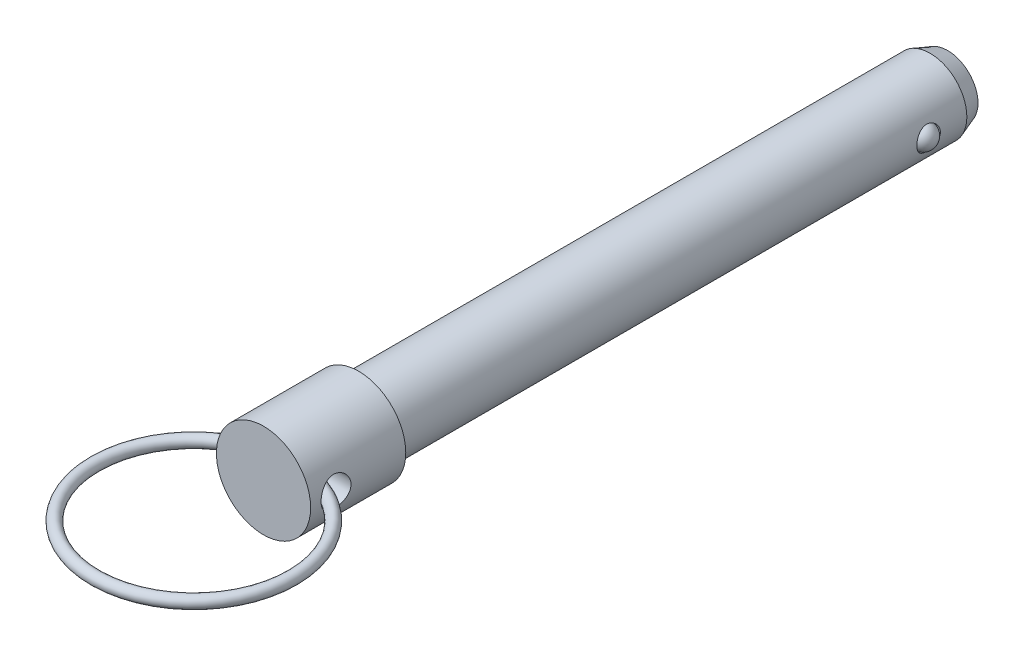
ISO-10303-21;
HEADER;
FILE_DESCRIPTION(('STEP AP214'),'2;1');
FILE_NAME('part.step','',(''),(''),'','','');
FILE_SCHEMA(('AUTOMOTIVE_DESIGN { 1 0 10303 214 1 1 1 1 }'));
ENDSEC;
DATA;
#1=APPLICATION_CONTEXT('core data for automotive mechanical design processes');
#2=APPLICATION_PROTOCOL_DEFINITION('international standard','automotive_design',2000,#1);
#3=PRODUCT_CONTEXT('',#1,'mechanical');
#4=PRODUCT('Part','Part','',(#3));
#5=PRODUCT_RELATED_PRODUCT_CATEGORY('part','',(#4));
#6=PRODUCT_DEFINITION_FORMATION('','',#4);
#7=PRODUCT_DEFINITION_CONTEXT('part definition',#1,'design');
#8=PRODUCT_DEFINITION('design','',#6,#7);
#9=PRODUCT_DEFINITION_SHAPE('','',#8);
#10=(LENGTH_UNIT() NAMED_UNIT(*) SI_UNIT(.MILLI.,.METRE.));
#11=(NAMED_UNIT(*) PLANE_ANGLE_UNIT() SI_UNIT($,.RADIAN.));
#12=(NAMED_UNIT(*) SI_UNIT($,.STERADIAN.) SOLID_ANGLE_UNIT());
#13=UNCERTAINTY_MEASURE_WITH_UNIT(LENGTH_MEASURE(1.E-05),#10,'distance_accuracy_value','');
#14=(GEOMETRIC_REPRESENTATION_CONTEXT(3) GLOBAL_UNCERTAINTY_ASSIGNED_CONTEXT((#13)) GLOBAL_UNIT_ASSIGNED_CONTEXT((#10,
#11,#12)) REPRESENTATION_CONTEXT('',''));
#15=CARTESIAN_POINT('',(0.,0.,0.));
#16=DIRECTION('',(0.,0.,1.));
#17=DIRECTION('',(1.,0.,0.));
#18=AXIS2_PLACEMENT_3D('',#15,#16,#17);
#19=CARTESIAN_POINT('',(7.9375,0.,9.398));
#20=DIRECTION('',(-1.,0.,0.));
#21=DIRECTION('',(0.,0.,-1.));
#22=AXIS2_PLACEMENT_3D('',#19,#20,#21);
#23=CYLINDRICAL_SURFACE('',#22,2.0193);
#24=CARTESIAN_POINT('',(-6.3502,0.292157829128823,11.3960531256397));
#25=CARTESIAN_POINT('',(-6.33446408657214,0.262361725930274,11.4004344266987));
#26=CARTESIAN_POINT('',(-6.32102794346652,0.231225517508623,11.4042829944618));
#27=CARTESIAN_POINT('',(-6.2992523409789,0.167152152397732,11.4106204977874));
#28=CARTESIAN_POINT('',(-6.29090461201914,0.134218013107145,11.413111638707));
#29=CARTESIAN_POINT('',(-6.2797291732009,0.0672091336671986,11.4164621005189));
#30=CARTESIAN_POINT('',(-6.27692077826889,0.0331308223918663,11.4173157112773));
#31=CARTESIAN_POINT('',(-6.27702601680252,-0.0350157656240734,11.4172838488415));
#32=CARTESIAN_POINT('',(-6.27993956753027,-0.0690840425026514,11.4163984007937));
#33=CARTESIAN_POINT('',(-6.29126629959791,-0.135748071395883,11.4130038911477));
#34=CARTESIAN_POINT('',(-6.2996097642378,-0.168356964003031,11.4105154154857));
#35=CARTESIAN_POINT('',(-6.32127848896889,-0.231802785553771,11.404211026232));
#36=CARTESIAN_POINT('',(-6.33461136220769,-0.262636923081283,11.4003930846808));
#37=CARTESIAN_POINT('',(-6.3502,-0.292157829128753,11.3960531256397));
#38=B_SPLINE_CURVE_WITH_KNOTS('',3,(#24,#25,#26,#27,#28,#29,#30,#31,#32,#33,#34,#35,#36,#37),
.UNSPECIFIED.,.F.,.F.,(4,2,2,2,2,2,4),(0.,0.101899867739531,0.203633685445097,0.305721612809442,
0.407808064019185,0.508608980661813,0.609564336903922),.UNSPECIFIED.);
#39=CARTESIAN_POINT('',(-6.3438349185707,0.2797472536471,11.3978284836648));
#40=VERTEX_POINT('',#39);
#41=CARTESIAN_POINT('',(-6.34383491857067,-0.279747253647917,11.3978284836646));
#42=VERTEX_POINT('',#41);
#43=EDGE_CURVE('E40',#40,#42,#38,.T.);
#44=ORIENTED_EDGE('',*,*,#43,.F.);
#45=CARTESIAN_POINT('',(-6.35,0.,11.4173));
#46=CARTESIAN_POINT('',(-6.34999578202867,-0.110312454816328,11.417293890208));
#47=CARTESIAN_POINT('',(-6.34709412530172,-0.220741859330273,11.4082188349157));
#48=CARTESIAN_POINT('',(-6.3357852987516,-0.438477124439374,11.3722159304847));
#49=CARTESIAN_POINT('',(-6.3273687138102,-0.545777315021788,11.3452575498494));
#50=CARTESIAN_POINT('',(-6.30595235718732,-0.753914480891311,11.2744960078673));
#51=CARTESIAN_POINT('',(-6.29296259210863,-0.85476500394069,11.2307296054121));
#52=CARTESIAN_POINT('',(-6.26374009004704,-1.04765917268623,11.1277235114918));
#53=CARTESIAN_POINT('',(-6.24750783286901,-1.13970411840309,11.0684861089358));
#54=CARTESIAN_POINT('',(-6.2129360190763,-1.31536123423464,10.9342184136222));
#55=CARTESIAN_POINT('',(-6.19454917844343,-1.39865352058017,10.8587818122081));
#56=CARTESIAN_POINT('',(-6.15801023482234,-1.55164747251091,10.6951184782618));
#57=CARTESIAN_POINT('',(-6.13985819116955,-1.62134576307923,10.606888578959));
#58=CARTESIAN_POINT('',(-6.1053372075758,-1.74691684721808,10.4173629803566));
#59=CARTESIAN_POINT('',(-6.08902613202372,-1.80238797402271,10.315789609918));
#60=CARTESIAN_POINT('',(-6.06074349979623,-1.89532725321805,10.104153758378));
#61=CARTESIAN_POINT('',(-6.04877073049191,-1.93280043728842,9.99409365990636));
#62=CARTESIAN_POINT('',(-6.03101341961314,-1.9875076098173,9.77220930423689));
#63=CARTESIAN_POINT('',(-6.0250482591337,-2.00533395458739,9.66054596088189));
#64=CARTESIAN_POINT('',(-6.01944581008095,-2.02209234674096,9.43566621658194));
#65=CARTESIAN_POINT('',(-6.01980677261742,-2.02102961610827,9.32245025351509));
#66=CARTESIAN_POINT('',(-6.02665663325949,-2.0005025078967,9.10261826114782));
#67=CARTESIAN_POINT('',(-6.03289303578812,-1.98179631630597,8.99592223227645));
#68=CARTESIAN_POINT('',(-6.05038018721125,-1.92774435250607,8.78726894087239));
#69=CARTESIAN_POINT('',(-6.06163151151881,-1.89239667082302,8.68531222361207));
#70=CARTESIAN_POINT('',(-6.08807105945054,-1.80553890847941,8.48724541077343));
#71=CARTESIAN_POINT('',(-6.1033159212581,-1.75379385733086,8.39124624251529));
#72=CARTESIAN_POINT('',(-6.13599834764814,-1.63577635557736,8.20905256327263));
#73=CARTESIAN_POINT('',(-6.15343637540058,-1.56950083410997,8.12286013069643));
#74=CARTESIAN_POINT('',(-6.18954615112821,-1.42061516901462,7.95845350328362));
#75=CARTESIAN_POINT('',(-6.20823733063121,-1.33738288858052,7.88080597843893));
#76=CARTESIAN_POINT('',(-6.2440320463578,-1.15881168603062,7.74040227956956));
#77=CARTESIAN_POINT('',(-6.26113489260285,-1.06346754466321,7.67765255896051));
#78=CARTESIAN_POINT('',(-6.29201953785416,-0.862230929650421,7.56842117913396));
#79=CARTESIAN_POINT('',(-6.30576997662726,-0.756251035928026,7.5220914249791));
#80=CARTESIAN_POINT('',(-6.32815272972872,-0.537579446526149,7.448167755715));
#81=CARTESIAN_POINT('',(-6.3367955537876,-0.42490206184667,7.4205353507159));
#82=CARTESIAN_POINT('',(-6.34491251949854,-0.259333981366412,7.39474486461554));
#83=CARTESIAN_POINT('',(-6.3468148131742,-0.207677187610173,7.38873516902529));
#84=CARTESIAN_POINT('',(-6.34935954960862,-0.104022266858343,7.38071129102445));
#85=CARTESIAN_POINT('',(-6.35000198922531,-0.0520241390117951,7.37869711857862));
#86=CARTESIAN_POINT('',(-6.34999578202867,0.110312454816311,7.37870610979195));
#87=CARTESIAN_POINT('',(-6.34709412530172,0.220741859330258,7.38778116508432));
#88=CARTESIAN_POINT('',(-6.33578529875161,0.438477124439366,7.4237840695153));
#89=CARTESIAN_POINT('',(-6.32736871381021,0.545777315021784,7.45074245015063));
#90=CARTESIAN_POINT('',(-6.30595235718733,0.753914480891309,7.52150399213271));
#91=CARTESIAN_POINT('',(-6.29296259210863,0.854765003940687,7.56527039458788));
#92=CARTESIAN_POINT('',(-6.26374009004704,1.04765917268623,7.66827648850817));
#93=CARTESIAN_POINT('',(-6.24750783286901,1.13970411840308,7.72751389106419));
#94=CARTESIAN_POINT('',(-6.2129360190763,1.31536123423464,7.86178158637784));
#95=CARTESIAN_POINT('',(-6.19454917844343,1.39865352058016,7.93721818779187));
#96=CARTESIAN_POINT('',(-6.15801023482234,1.55164747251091,8.10088152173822));
#97=CARTESIAN_POINT('',(-6.13985819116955,1.62134576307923,8.18911142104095));
#98=CARTESIAN_POINT('',(-6.1053372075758,1.74691684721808,8.37863701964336));
#99=CARTESIAN_POINT('',(-6.08902613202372,1.80238797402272,8.48021039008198));
#100=CARTESIAN_POINT('',(-6.06074349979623,1.89532725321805,8.69184624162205));
#101=CARTESIAN_POINT('',(-6.04877073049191,1.93280043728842,8.80190634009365));
#102=CARTESIAN_POINT('',(-6.03101341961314,1.9875076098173,9.02379069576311));
#103=CARTESIAN_POINT('',(-6.0250482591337,2.00533395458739,9.13545403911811));
#104=CARTESIAN_POINT('',(-6.01944581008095,2.02209234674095,9.36033378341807));
#105=CARTESIAN_POINT('',(-6.01980677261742,2.02102961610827,9.47354974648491));
#106=CARTESIAN_POINT('',(-6.02665663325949,2.00050250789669,9.69338173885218));
#107=CARTESIAN_POINT('',(-6.03289303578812,1.98179631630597,9.80007776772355));
#108=CARTESIAN_POINT('',(-6.05038018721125,1.92774435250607,10.0087310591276));
#109=CARTESIAN_POINT('',(-6.06163151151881,1.89239667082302,10.1106877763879));
#110=CARTESIAN_POINT('',(-6.08807105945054,1.80553890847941,10.3087545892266));
#111=CARTESIAN_POINT('',(-6.1033159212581,1.75379385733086,10.4047537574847));
#112=CARTESIAN_POINT('',(-6.13599834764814,1.63577635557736,10.5869474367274));
#113=CARTESIAN_POINT('',(-6.15343637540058,1.56950083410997,10.6731398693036));
#114=CARTESIAN_POINT('',(-6.18954615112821,1.42061516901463,10.8375464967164));
#115=CARTESIAN_POINT('',(-6.20823733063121,1.33738288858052,10.9151940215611));
#116=CARTESIAN_POINT('',(-6.2440320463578,1.15881168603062,11.0555977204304));
#117=CARTESIAN_POINT('',(-6.26113489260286,1.06346754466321,11.1183474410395));
#118=CARTESIAN_POINT('',(-6.29201953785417,0.862230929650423,11.227578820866));
#119=CARTESIAN_POINT('',(-6.30576997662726,0.756251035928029,11.2739085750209));
#120=CARTESIAN_POINT('',(-6.32815272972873,0.53757944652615,11.347832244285));
#121=CARTESIAN_POINT('',(-6.33679555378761,0.424902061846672,11.3754646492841));
#122=CARTESIAN_POINT('',(-6.34491251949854,0.25933398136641,11.4012551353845));
#123=CARTESIAN_POINT('',(-6.34681481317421,0.207677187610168,11.4072648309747));
#124=CARTESIAN_POINT('',(-6.34935954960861,0.10402226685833,11.4152887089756));
#125=CARTESIAN_POINT('',(-6.35000198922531,0.0520241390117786,11.4173028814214));
#126=CARTESIAN_POINT('',(-6.35,0.,11.4173));
#127=B_SPLINE_CURVE_WITH_KNOTS('',3,(#45,#46,#47,#48,#49,#50,#51,#52,#53,#54,#55,#56,#57,#58,
#59,#60,#61,#62,#63,#64,#65,#66,#67,#68,#69,#70,#71,#72,#73,#74,#75,#76,#77,#78,#79,#80,#81,#82,
#83,#84,#85,#86,#87,#88,#89,#90,#91,#92,#93,#94,#95,#96,#97,#98,#99,#100,#101,#102,#103,#104,
#105,#106,#107,#108,#109,#110,#111,#112,#113,#114,#115,#116,#117,#118,#119,#120,#121,#122,#123,
#124,#125,#126),.UNSPECIFIED.,.T.,.F.,(4,2,2,2,2,2,2,2,2,2,2,2,2,2,2,2,2,2,2,2,2,2,2,2,2,2,2,2,
2,2,2,2,2,2,2,2,2,2,2,2,4),(0.,0.33073688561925,0.662039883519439,0.992622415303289,
1.32315606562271,1.66322530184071,2.00337886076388,2.35228054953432,2.70108463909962,
3.0390572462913,3.37693642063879,3.70092724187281,4.02495524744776,4.35385413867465,
4.68282260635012,5.02727904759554,5.37188442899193,5.71959937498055,6.06659632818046,
6.22257380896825,6.37855167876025,6.70928856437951,7.04059156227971,7.37117409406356,
7.70170774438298,8.04177698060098,8.38193053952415,8.73083222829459,9.0796363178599,
9.41760892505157,9.75548809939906,10.0794789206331,10.403506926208,10.7324058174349,
11.0613742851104,11.4058307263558,11.7504361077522,12.0981510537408,12.4451480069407,
12.6011254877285,12.7571033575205),.UNSPECIFIED.);
#128=EDGE_CURVE('E66',#42,#40,#127,.T.);
#129=ORIENTED_EDGE('',*,*,#128,.F.);
#130=EDGE_LOOP('',(#44,#129));
#131=FACE_BOUND('',#130,.T.);
#132=CARTESIAN_POINT('',(6.3502,-0.292157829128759,11.3960531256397));
#133=CARTESIAN_POINT('',(6.33446408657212,-0.262361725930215,11.4004344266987));
#134=CARTESIAN_POINT('',(6.32102794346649,-0.231225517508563,11.4042829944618));
#135=CARTESIAN_POINT('',(6.29925234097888,-0.167152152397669,11.4106204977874));
#136=CARTESIAN_POINT('',(6.29090461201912,-0.13421801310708,11.413111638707));
#137=CARTESIAN_POINT('',(6.27972917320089,-0.0672091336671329,11.4164621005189));
#138=CARTESIAN_POINT('',(6.27692077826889,-0.0331308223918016,11.4173157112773));
#139=CARTESIAN_POINT('',(6.27702601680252,0.0350157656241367,11.4172838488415));
#140=CARTESIAN_POINT('',(6.27993956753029,0.0690840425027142,11.4163984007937));
#141=CARTESIAN_POINT('',(6.29126629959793,0.135748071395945,11.4130038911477));
#142=CARTESIAN_POINT('',(6.29960976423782,0.168356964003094,11.4105154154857));
#143=CARTESIAN_POINT('',(6.3212784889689,0.231802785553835,11.4042110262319));
#144=CARTESIAN_POINT('',(6.3346113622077,0.262636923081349,11.4003930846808));
#145=CARTESIAN_POINT('',(6.3502,0.292157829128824,11.3960531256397));
#146=B_SPLINE_CURVE_WITH_KNOTS('',3,(#132,#133,#134,#135,#136,#137,#138,#139,#140,#141,#142,
#143,#144,#145),.UNSPECIFIED.,.F.,.F.,(4,2,2,2,2,2,4),(0.,0.101899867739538,0.203633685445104,
0.305721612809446,0.40780806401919,0.508608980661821,0.609564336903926),.UNSPECIFIED.);
#147=CARTESIAN_POINT('',(6.3438349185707,-0.279747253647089,11.3978284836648));
#148=VERTEX_POINT('',#147);
#149=CARTESIAN_POINT('',(6.34383491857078,0.279747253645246,11.397828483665));
#150=VERTEX_POINT('',#149);
#151=EDGE_CURVE('E33',#148,#150,#146,.T.);
#152=ORIENTED_EDGE('',*,*,#151,.F.);
#153=CARTESIAN_POINT('',(6.35,0.,7.3787));
#154=CARTESIAN_POINT('',(6.34999578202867,-0.110312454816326,7.37870610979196));
#155=CARTESIAN_POINT('',(6.34709412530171,-0.22074185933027,7.38778116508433));
#156=CARTESIAN_POINT('',(6.3357852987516,-0.438477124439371,7.4237840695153));
#157=CARTESIAN_POINT('',(6.32736871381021,-0.545777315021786,7.45074245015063));
#158=CARTESIAN_POINT('',(6.30595235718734,-0.753914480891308,7.52150399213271));
#159=CARTESIAN_POINT('',(6.29296259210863,-0.854765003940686,7.56527039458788));
#160=CARTESIAN_POINT('',(6.26374009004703,-1.04765917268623,7.66827648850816));
#161=CARTESIAN_POINT('',(6.247507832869,-1.13970411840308,7.72751389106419));
#162=CARTESIAN_POINT('',(6.21293601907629,-1.31536123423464,7.86178158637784));
#163=CARTESIAN_POINT('',(6.19454917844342,-1.39865352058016,7.93721818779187));
#164=CARTESIAN_POINT('',(6.15801023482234,-1.55164747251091,8.10088152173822));
#165=CARTESIAN_POINT('',(6.13985819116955,-1.62134576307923,8.18911142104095));
#166=CARTESIAN_POINT('',(6.1053372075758,-1.74691684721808,8.37863701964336));
#167=CARTESIAN_POINT('',(6.08902613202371,-1.80238797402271,8.48021039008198));
#168=CARTESIAN_POINT('',(6.06074349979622,-1.89532725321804,8.69184624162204));
#169=CARTESIAN_POINT('',(6.04877073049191,-1.93280043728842,8.80190634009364));
#170=CARTESIAN_POINT('',(6.03101341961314,-1.9875076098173,9.02379069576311));
#171=CARTESIAN_POINT('',(6.02504825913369,-2.00533395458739,9.13545403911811));
#172=CARTESIAN_POINT('',(6.01944581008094,-2.02209234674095,9.36033378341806));
#173=CARTESIAN_POINT('',(6.01980677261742,-2.02102961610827,9.47354974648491));
#174=CARTESIAN_POINT('',(6.02665663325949,-2.00050250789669,9.69338173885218));
#175=CARTESIAN_POINT('',(6.03289303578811,-1.98179631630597,9.80007776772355));
#176=CARTESIAN_POINT('',(6.05038018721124,-1.92774435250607,10.0087310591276));
#177=CARTESIAN_POINT('',(6.06163151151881,-1.89239667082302,10.1106877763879));
#178=CARTESIAN_POINT('',(6.08807105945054,-1.80553890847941,10.3087545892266));
#179=CARTESIAN_POINT('',(6.1033159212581,-1.75379385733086,10.4047537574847));
#180=CARTESIAN_POINT('',(6.13599834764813,-1.63577635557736,10.5869474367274));
#181=CARTESIAN_POINT('',(6.15343637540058,-1.56950083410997,10.6731398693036));
#182=CARTESIAN_POINT('',(6.18954615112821,-1.42061516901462,10.8375464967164));
#183=CARTESIAN_POINT('',(6.2082373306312,-1.33738288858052,10.9151940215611));
#184=CARTESIAN_POINT('',(6.24403204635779,-1.15881168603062,11.0555977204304));
#185=CARTESIAN_POINT('',(6.26113489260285,-1.06346754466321,11.1183474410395));
#186=CARTESIAN_POINT('',(6.29201953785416,-0.862230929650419,11.227578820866));
#187=CARTESIAN_POINT('',(6.30576997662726,-0.756251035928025,11.2739085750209));
#188=CARTESIAN_POINT('',(6.32815272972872,-0.537579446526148,11.347832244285));
#189=CARTESIAN_POINT('',(6.3367955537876,-0.424902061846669,11.3754646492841));
#190=CARTESIAN_POINT('',(6.34491251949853,-0.25933398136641,11.4012551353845));
#191=CARTESIAN_POINT('',(6.3468148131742,-0.207677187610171,11.4072648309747));
#192=CARTESIAN_POINT('',(6.34935954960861,-0.10402226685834,11.4152887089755));
#193=CARTESIAN_POINT('',(6.35000198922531,-0.0520241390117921,11.4173028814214));
#194=CARTESIAN_POINT('',(6.34999578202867,0.110312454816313,11.417293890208));
#195=CARTESIAN_POINT('',(6.34709412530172,0.220741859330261,11.4082188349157));
#196=CARTESIAN_POINT('',(6.33578529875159,0.438477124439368,11.3722159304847));
#197=CARTESIAN_POINT('',(6.3273687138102,0.545777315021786,11.3452575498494));
#198=CARTESIAN_POINT('',(6.30595235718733,0.753914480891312,11.2744960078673));
#199=CARTESIAN_POINT('',(6.29296259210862,0.854765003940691,11.2307296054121));
#200=CARTESIAN_POINT('',(6.26374009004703,1.04765917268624,11.1277235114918));
#201=CARTESIAN_POINT('',(6.247507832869,1.13970411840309,11.0684861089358));
#202=CARTESIAN_POINT('',(6.21293601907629,1.31536123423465,10.9342184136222));
#203=CARTESIAN_POINT('',(6.19454917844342,1.39865352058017,10.8587818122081));
#204=CARTESIAN_POINT('',(6.15801023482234,1.55164747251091,10.6951184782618));
#205=CARTESIAN_POINT('',(6.13985819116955,1.62134576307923,10.606888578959));
#206=CARTESIAN_POINT('',(6.1053372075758,1.74691684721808,10.4173629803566));
#207=CARTESIAN_POINT('',(6.08902613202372,1.80238797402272,10.315789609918));
#208=CARTESIAN_POINT('',(6.06074349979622,1.89532725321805,10.104153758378));
#209=CARTESIAN_POINT('',(6.0487707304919,1.93280043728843,9.99409365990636));
#210=CARTESIAN_POINT('',(6.03101341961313,1.9875076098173,9.77220930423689));
#211=CARTESIAN_POINT('',(6.02504825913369,2.0053339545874,9.66054596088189));
#212=CARTESIAN_POINT('',(6.01944581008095,2.02209234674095,9.43566621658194));
#213=CARTESIAN_POINT('',(6.01980677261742,2.02102961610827,9.32245025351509));
#214=CARTESIAN_POINT('',(6.02665663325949,2.00050250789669,9.10261826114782));
#215=CARTESIAN_POINT('',(6.03289303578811,1.98179631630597,8.99592223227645));
#216=CARTESIAN_POINT('',(6.05038018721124,1.92774435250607,8.78726894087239));
#217=CARTESIAN_POINT('',(6.06163151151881,1.89239667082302,8.68531222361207));
#218=CARTESIAN_POINT('',(6.08807105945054,1.80553890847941,8.48724541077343));
#219=CARTESIAN_POINT('',(6.1033159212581,1.75379385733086,8.39124624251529));
#220=CARTESIAN_POINT('',(6.13599834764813,1.63577635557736,8.20905256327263));
#221=CARTESIAN_POINT('',(6.15343637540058,1.56950083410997,8.12286013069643));
#222=CARTESIAN_POINT('',(6.18954615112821,1.42061516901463,7.95845350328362));
#223=CARTESIAN_POINT('',(6.2082373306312,1.33738288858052,7.88080597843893));
#224=CARTESIAN_POINT('',(6.24403204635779,1.15881168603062,7.74040227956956));
#225=CARTESIAN_POINT('',(6.26113489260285,1.06346754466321,7.67765255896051));
#226=CARTESIAN_POINT('',(6.29201953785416,0.862230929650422,7.56842117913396));
#227=CARTESIAN_POINT('',(6.30576997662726,0.756251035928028,7.5220914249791));
#228=CARTESIAN_POINT('',(6.32815272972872,0.53757944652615,7.448167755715));
#229=CARTESIAN_POINT('',(6.3367955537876,0.424902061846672,7.4205353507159));
#230=CARTESIAN_POINT('',(6.34491251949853,0.25933398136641,7.39474486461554));
#231=CARTESIAN_POINT('',(6.3468148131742,0.207677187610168,7.38873516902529));
#232=CARTESIAN_POINT('',(6.34935954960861,0.104022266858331,7.38071129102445));
#233=CARTESIAN_POINT('',(6.35000198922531,0.0520241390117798,7.37869711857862));
#234=CARTESIAN_POINT('',(6.35,0.,7.3787));
#235=B_SPLINE_CURVE_WITH_KNOTS('',3,(#153,#154,#155,#156,#157,#158,#159,#160,#161,#162,#163,
#164,#165,#166,#167,#168,#169,#170,#171,#172,#173,#174,#175,#176,#177,#178,#179,#180,#181,#182,
#183,#184,#185,#186,#187,#188,#189,#190,#191,#192,#193,#194,#195,#196,#197,#198,#199,#200,#201,
#202,#203,#204,#205,#206,#207,#208,#209,#210,#211,#212,#213,#214,#215,#216,#217,#218,#219,#220,
#221,#222,#223,#224,#225,#226,#227,#228,#229,#230,#231,#232,#233,#234),.UNSPECIFIED.,.T.,.F.,(4,
2,2,2,2,2,2,2,2,2,2,2,2,2,2,2,2,2,2,2,2,2,2,2,2,2,2,2,2,2,2,2,2,2,2,2,2,2,2,2,4),(0.,
0.330736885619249,0.662039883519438,0.992622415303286,1.32315606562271,1.66322530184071,
2.00337886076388,2.35228054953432,2.70108463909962,3.0390572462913,3.37693642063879,
3.7009272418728,4.02495524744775,4.35385413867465,4.68282260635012,5.02727904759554,
5.37188442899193,5.71959937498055,6.06659632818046,6.22257380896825,6.37855167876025,
6.70928856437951,7.04059156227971,7.37117409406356,7.70170774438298,8.04177698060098,
8.38193053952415,8.73083222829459,9.07963631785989,9.41760892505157,9.75548809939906,
10.0794789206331,10.403506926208,10.7324058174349,11.0613742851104,11.4058307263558,
11.7504361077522,12.0981510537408,12.4451480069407,12.6011254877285,12.7571033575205),.UNSPECIFIED.);
#236=EDGE_CURVE('E62',#150,#148,#235,.T.);
#237=ORIENTED_EDGE('',*,*,#236,.F.);
#238=EDGE_LOOP('',(#152,#237));
#239=FACE_BOUND('',#238,.T.);
#240=ADVANCED_FACE('F14',(#131,#239),#23,.F.);
#241=CARTESIAN_POINT('',(0.,0.,-34.39922));
#242=DIRECTION('',(0.,0.,-1.));
#243=DIRECTION('',(1.,0.,0.));
#244=AXIS2_PLACEMENT_3D('',#241,#242,#243);
#245=CYLINDRICAL_SURFACE('',#244,6.35);
#246=ORIENTED_EDGE('',*,*,#236,.T.);
#247=CARTESIAN_POINT('',(6.34911067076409,-0.106292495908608,9.64531337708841));
#248=CARTESIAN_POINT('',(6.3483941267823,-0.149074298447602,9.65137725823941));
#249=CARTESIAN_POINT('',(6.34724965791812,-0.191344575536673,9.66110939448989));
#250=CARTESIAN_POINT('',(6.34423605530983,-0.273618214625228,9.68758101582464));
#251=CARTESIAN_POINT('',(6.34236646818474,-0.3136201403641,9.704324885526));
#252=CARTESIAN_POINT('',(6.3381174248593,-0.39017545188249,9.74421775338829));
#253=CARTESIAN_POINT('',(6.33573876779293,-0.42673411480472,9.76735672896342));
#254=CARTESIAN_POINT('',(6.33072830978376,-0.495552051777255,9.8192835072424));
#255=CARTESIAN_POINT('',(6.32809652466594,-0.527811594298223,9.84807095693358));
#256=CARTESIAN_POINT('',(6.32277775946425,-0.588154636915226,9.91124388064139));
#257=CARTESIAN_POINT('',(6.32009122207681,-0.616100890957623,9.94576018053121));
#258=CARTESIAN_POINT('',(6.31500218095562,-0.666246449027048,10.0187508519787));
#259=CARTESIAN_POINT('',(6.31259974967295,-0.688444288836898,10.0572262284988));
#260=CARTESIAN_POINT('',(6.30814194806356,-0.72820004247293,10.1398945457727));
#261=CARTESIAN_POINT('',(6.30612298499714,-0.745320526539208,10.1842993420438));
#262=CARTESIAN_POINT('',(6.30283333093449,-0.772645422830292,10.2752074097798));
#263=CARTESIAN_POINT('',(6.30156294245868,-0.782847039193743,10.3217115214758));
#264=CARTESIAN_POINT('',(6.2997729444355,-0.797132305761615,10.4203656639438));
#265=CARTESIAN_POINT('',(6.29934001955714,-0.800511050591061,10.4726191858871));
#266=CARTESIAN_POINT('',(6.29948539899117,-0.799363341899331,10.5770343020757));
#267=CARTESIAN_POINT('',(6.30006412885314,-0.79483356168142,10.6291958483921));
#268=CARTESIAN_POINT('',(6.30224519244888,-0.777362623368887,10.7373900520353));
#269=CARTESIAN_POINT('',(6.30394321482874,-0.763632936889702,10.7932945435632));
#270=CARTESIAN_POINT('',(6.3082304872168,-0.727364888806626,10.9021925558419));
#271=CARTESIAN_POINT('',(6.31082057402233,-0.704818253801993,10.9551832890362));
#272=CARTESIAN_POINT('',(6.31668084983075,-0.65024958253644,11.058462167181));
#273=CARTESIAN_POINT('',(6.31997188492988,-0.617920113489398,11.108588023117));
#274=CARTESIAN_POINT('',(6.32672369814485,-0.544444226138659,11.2018715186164));
#275=CARTESIAN_POINT('',(6.33018413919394,-0.503314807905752,11.2450423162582));
#276=CARTESIAN_POINT('',(6.33576833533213,-0.426106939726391,11.3105875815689));
#277=CARTESIAN_POINT('',(6.3379874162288,-0.392058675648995,11.3353540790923));
#278=CARTESIAN_POINT('',(6.34201635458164,-0.320334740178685,11.378985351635));
#279=CARTESIAN_POINT('',(6.34382654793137,-0.282662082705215,11.3978549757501));
#280=CARTESIAN_POINT('',(6.34683709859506,-0.204222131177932,11.4286907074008));
#281=CARTESIAN_POINT('',(6.34803303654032,-0.163434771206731,11.4406068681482));
#282=CARTESIAN_POINT('',(6.34962760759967,-0.080315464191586,11.456409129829));
#283=CARTESIAN_POINT('',(6.35002678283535,-0.0379845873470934,11.4603006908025));
#284=CARTESIAN_POINT('',(6.34997361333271,0.0416311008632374,11.4597766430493));
#285=CARTESIAN_POINT('',(6.34961570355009,0.0789250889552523,11.4562823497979));
#286=CARTESIAN_POINT('',(6.34827799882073,0.152365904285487,11.4430416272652));
#287=CARTESIAN_POINT('',(6.34729819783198,0.188512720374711,11.4332951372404));
#288=CARTESIAN_POINT('',(6.34483463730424,0.258437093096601,11.4082426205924));
#289=CARTESIAN_POINT('',(6.34335520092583,0.292232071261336,11.392984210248));
#290=CARTESIAN_POINT('',(6.3400309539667,0.35716430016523,11.3576448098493));
#291=CARTESIAN_POINT('',(6.33818602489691,0.388300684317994,11.3375622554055));
#292=CARTESIAN_POINT('',(6.33403341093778,0.451264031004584,11.2905464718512));
#293=CARTESIAN_POINT('',(6.33169671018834,0.482680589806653,11.2630681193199));
#294=CARTESIAN_POINT('',(6.32695276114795,0.541327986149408,11.2039742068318));
#295=CARTESIAN_POINT('',(6.32454547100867,0.568556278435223,11.1723561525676));
#296=CARTESIAN_POINT('',(6.31940966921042,0.623257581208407,11.0997303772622));
#297=CARTESIAN_POINT('',(6.31670324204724,0.649859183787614,11.0580641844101));
#298=CARTESIAN_POINT('',(6.31169900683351,0.696787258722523,10.9713122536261));
#299=CARTESIAN_POINT('',(6.30940147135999,0.717109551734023,10.9262242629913));
#300=CARTESIAN_POINT('',(6.30511939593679,0.753900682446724,10.8265682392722));
#301=CARTESIAN_POINT('',(6.30323580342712,0.769311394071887,10.7716021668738));
#302=CARTESIAN_POINT('',(6.30052520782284,0.791204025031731,10.6598731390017));
#303=CARTESIAN_POINT('',(6.2996986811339,0.79768191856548,10.6031093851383));
#304=CARTESIAN_POINT('',(6.29923241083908,0.80136018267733,10.4867557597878));
#305=CARTESIAN_POINT('',(6.2996462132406,0.798141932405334,10.4271509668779));
#306=CARTESIAN_POINT('',(6.30178827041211,0.781050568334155,10.3094933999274));
#307=CARTESIAN_POINT('',(6.30351599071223,0.767181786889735,10.2514400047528));
#308=CARTESIAN_POINT('',(6.30793273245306,0.729936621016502,10.1430301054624));
#309=CARTESIAN_POINT('',(6.31054579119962,0.707295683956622,10.0924193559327));
#310=CARTESIAN_POINT('',(6.316412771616,0.652821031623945,9.9964473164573));
#311=CARTESIAN_POINT('',(6.31966615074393,0.620995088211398,9.95108163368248));
#312=CARTESIAN_POINT('',(6.3259599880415,0.552954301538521,9.87232840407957));
#313=CARTESIAN_POINT('',(6.32898344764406,0.517631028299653,9.83816824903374));
#314=CARTESIAN_POINT('',(6.33476504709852,0.441261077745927,9.77694761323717));
#315=CARTESIAN_POINT('',(6.33752330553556,0.400216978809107,9.74988394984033));
#316=CARTESIAN_POINT('',(6.34218417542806,0.317440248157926,9.70596453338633));
#317=CARTESIAN_POINT('',(6.34413984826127,0.276067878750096,9.68843287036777));
#318=CARTESIAN_POINT('',(6.34727291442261,0.19088190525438,9.66089843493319));
#319=CARTESIAN_POINT('',(6.34845102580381,0.147070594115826,9.65088871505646));
#320=CARTESIAN_POINT('',(6.34972965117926,0.0681015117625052,9.64007587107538));
#321=CARTESIAN_POINT('',(6.35000959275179,0.0331486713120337,9.63773711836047));
#322=CARTESIAN_POINT('',(6.34998989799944,-0.0367451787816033,9.63790342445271));
#323=CARTESIAN_POINT('',(6.34969028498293,-0.0716861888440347,9.64040828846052));
#324=CARTESIAN_POINT('',(6.34911067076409,-0.106292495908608,9.64531337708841));
#325=B_SPLINE_CURVE_WITH_KNOTS('',3,(#247,#248,#249,#250,#251,#252,#253,#254,#255,#256,#257,
#258,#259,#260,#261,#262,#263,#264,#265,#266,#267,#268,#269,#270,#271,#272,#273,#274,#275,#276,
#277,#278,#279,#280,#281,#282,#283,#284,#285,#286,#287,#288,#289,#290,#291,#292,#293,#294,#295,
#296,#297,#298,#299,#300,#301,#302,#303,#304,#305,#306,#307,#308,#309,#310,#311,#312,#313,#314,
#315,#316,#317,#318,#319,#320,#321,#322,#323,#324),.UNSPECIFIED.,.T.,.F.,(4,2,2,2,2,2,2,2,2,2,2,
2,2,2,2,2,2,2,2,2,2,2,2,2,2,2,2,2,2,2,2,2,2,2,2,2,2,2,4),(0.,0.129515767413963,
0.259112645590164,0.388507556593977,0.517894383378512,0.650795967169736,0.783731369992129,
0.926038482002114,1.06840306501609,1.22484845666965,1.38135967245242,1.55336962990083,
1.72554138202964,1.90381365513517,2.08174459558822,2.20773649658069,2.33362451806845,
2.4604060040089,2.58710119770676,2.69892768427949,2.81075525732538,2.92163901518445,
3.0325587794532,3.15750232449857,3.28252150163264,3.4304749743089,3.57852670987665,
3.74912471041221,3.91979957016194,4.09794717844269,4.27602235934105,4.44160182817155,
4.60704160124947,4.7539407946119,4.90077399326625,5.03502725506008,5.1691563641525,
5.27392620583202,5.37869183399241),.UNSPECIFIED.);
#326=EDGE_CURVE('E27',#148,#150,#325,.T.);
#327=ORIENTED_EDGE('',*,*,#326,.T.);
#328=EDGE_LOOP('',(#246,#327));
#329=FACE_BOUND('',#328,.T.);
#330=CARTESIAN_POINT('',(0.,0.,12.8270000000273));
#331=DIRECTION('',(0.,0.,-1.));
#332=DIRECTION('',(1.,0.,0.));
#333=AXIS2_PLACEMENT_3D('',#330,#331,#332);
#334=CIRCLE('',#333,6.34999999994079);
#335=CARTESIAN_POINT('',(6.34999999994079,0.,12.8270000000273));
#336=VERTEX_POINT('',#335);
#337=EDGE_CURVE('E70',#336,#336,#334,.T.);
#338=ORIENTED_EDGE('',*,*,#337,.T.);
#339=EDGE_LOOP('',(#338));
#340=FACE_BOUND('',#339,.T.);
#341=CARTESIAN_POINT('',(0.,0.,1.16018306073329E-11));
#342=DIRECTION('',(0.,0.,-1.));
#343=DIRECTION('',(1.,0.,0.));
#344=AXIS2_PLACEMENT_3D('',#341,#342,#343);
#345=CIRCLE('',#344,6.34999999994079);
#346=CARTESIAN_POINT('',(6.34999999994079,0.,1.16015507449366E-11));
#347=VERTEX_POINT('',#346);
#348=EDGE_CURVE('E60',#347,#347,#345,.T.);
#349=ORIENTED_EDGE('',*,*,#348,.F.);
#350=EDGE_LOOP('',(#349));
#351=FACE_BOUND('',#350,.T.);
#352=ORIENTED_EDGE('',*,*,#128,.T.);
#353=CARTESIAN_POINT('',(-6.3491106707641,-0.106292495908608,9.64531337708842));
#354=CARTESIAN_POINT('',(-6.34981427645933,-0.0642492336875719,9.63935614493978));
#355=CARTESIAN_POINT('',(-6.35010491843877,-0.0216882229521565,9.63693832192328));
#356=CARTESIAN_POINT('',(-6.34982708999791,0.0632451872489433,9.63926820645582));
#357=CARTESIAN_POINT('',(-6.34925830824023,0.105617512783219,9.64401851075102));
#358=CARTESIAN_POINT('',(-6.3473255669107,0.188929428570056,9.66052387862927));
#359=CARTESIAN_POINT('',(-6.34596206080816,0.229869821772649,9.67227494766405));
#360=CARTESIAN_POINT('',(-6.34259173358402,0.309205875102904,9.7023861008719));
#361=CARTESIAN_POINT('',(-6.34058494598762,0.347601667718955,9.72074584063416));
#362=CARTESIAN_POINT('',(-6.33612262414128,0.421219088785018,9.76368889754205));
#363=CARTESIAN_POINT('',(-6.33366281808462,0.456405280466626,9.78833239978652));
#364=CARTESIAN_POINT('',(-6.3285674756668,0.522330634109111,9.84295801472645));
#365=CARTESIAN_POINT('',(-6.32593191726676,0.553069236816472,9.87294079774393));
#366=CARTESIAN_POINT('',(-6.32063739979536,0.610668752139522,9.93869049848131));
#367=CARTESIAN_POINT('',(-6.31798210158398,0.637312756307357,9.97464737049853));
#368=CARTESIAN_POINT('',(-6.31302530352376,0.684675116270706,10.050284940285));
#369=CARTESIAN_POINT('',(-6.31072390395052,0.705391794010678,10.0899666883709));
#370=CARTESIAN_POINT('',(-6.3065253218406,0.742027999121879,10.1750481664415));
#371=CARTESIAN_POINT('',(-6.30467116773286,0.757473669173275,10.2206536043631));
#372=CARTESIAN_POINT('',(-6.30176158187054,0.781309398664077,10.3136897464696));
#373=CARTESIAN_POINT('',(-6.30070647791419,0.789696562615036,10.3611211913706));
#374=CARTESIAN_POINT('',(-6.29939708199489,0.800080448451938,10.4615517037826));
#375=CARTESIAN_POINT('',(-6.29923479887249,0.801343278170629,10.5146278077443));
#376=CARTESIAN_POINT('',(-6.29993274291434,0.795834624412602,10.6203535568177));
#377=CARTESIAN_POINT('',(-6.30079341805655,0.789059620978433,10.6730030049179));
#378=CARTESIAN_POINT('',(-6.30354435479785,0.76679085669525,10.7816321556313));
#379=CARTESIAN_POINT('',(-6.3055245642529,0.75053077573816,10.8374538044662));
#380=CARTESIAN_POINT('',(-6.3103170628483,0.709106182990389,10.9457204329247));
#381=CARTESIAN_POINT('',(-6.31313013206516,0.683933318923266,10.9981621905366));
#382=CARTESIAN_POINT('',(-6.31930287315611,0.624362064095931,11.0989766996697));
#383=CARTESIAN_POINT('',(-6.32267249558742,0.589786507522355,11.1472450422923));
#384=CARTESIAN_POINT('',(-6.32944316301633,0.512016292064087,11.2362287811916));
#385=CARTESIAN_POINT('',(-6.33284412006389,0.468841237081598,11.2769609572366));
#386=CARTESIAN_POINT('',(-6.3381447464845,0.389210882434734,11.3371705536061));
#387=CARTESIAN_POINT('',(-6.34018413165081,0.354783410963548,11.3593300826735));
#388=CARTESIAN_POINT('',(-6.34380499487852,0.282727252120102,11.3976985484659));
#389=CARTESIAN_POINT('',(-6.34538687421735,0.24510140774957,11.4139127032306));
#390=CARTESIAN_POINT('',(-6.34791613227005,0.16728046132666,11.4394899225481));
#391=CARTESIAN_POINT('',(-6.34885950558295,0.127070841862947,11.4488097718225));
#392=CARTESIAN_POINT('',(-6.34996657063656,0.0456031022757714,11.459723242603));
#393=CARTESIAN_POINT('',(-6.35013061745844,0.00434546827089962,11.4613203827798));
#394=CARTESIAN_POINT('',(-6.34968170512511,-0.0735082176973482,11.4569121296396));
#395=CARTESIAN_POINT('',(-6.34914631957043,-0.110150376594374,11.4516658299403));
#396=CARTESIAN_POINT('',(-6.34749195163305,-0.182042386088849,11.4351966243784));
#397=CARTESIAN_POINT('',(-6.3463729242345,-0.217292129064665,11.4239732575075));
#398=CARTESIAN_POINT('',(-6.34364878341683,-0.286046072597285,11.3959879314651));
#399=CARTESIAN_POINT('',(-6.34203717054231,-0.31951944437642,11.379151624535));
#400=CARTESIAN_POINT('',(-6.33848327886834,-0.383617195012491,11.3407750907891));
#401=CARTESIAN_POINT('',(-6.336540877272,-0.414240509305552,11.3192331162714));
#402=CARTESIAN_POINT('',(-6.33219640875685,-0.476327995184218,11.2689534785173));
#403=CARTESIAN_POINT('',(-6.32976799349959,-0.507315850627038,11.2396315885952));
#404=CARTESIAN_POINT('',(-6.32489282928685,-0.564859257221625,11.1769313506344));
#405=CARTESIAN_POINT('',(-6.32244606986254,-0.591412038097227,11.1435504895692));
#406=CARTESIAN_POINT('',(-6.31728331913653,-0.644412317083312,11.0671373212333));
#407=CARTESIAN_POINT('',(-6.31460099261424,-0.669935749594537,11.0234608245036));
#408=CARTESIAN_POINT('',(-6.3097291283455,-0.714365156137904,10.9328329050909));
#409=CARTESIAN_POINT('',(-6.30753991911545,-0.733266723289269,10.8858793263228));
#410=CARTESIAN_POINT('',(-6.30360262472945,-0.766429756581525,10.7829444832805));
#411=CARTESIAN_POINT('',(-6.30196031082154,-0.779660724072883,10.7266239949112));
#412=CARTESIAN_POINT('',(-6.29981098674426,-0.796841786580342,10.6125408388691));
#413=CARTESIAN_POINT('',(-6.29930438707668,-0.800788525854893,10.5547776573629));
#414=CARTESIAN_POINT('',(-6.29954116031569,-0.798927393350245,10.4378617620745));
#415=CARTESIAN_POINT('',(-6.30031766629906,-0.792860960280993,10.3787123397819));
#416=CARTESIAN_POINT('',(-6.3031448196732,-0.770063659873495,10.2625195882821));
#417=CARTESIAN_POINT('',(-6.30519479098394,-0.753338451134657,10.2054751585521));
#418=CARTESIAN_POINT('',(-6.31011127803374,-0.710921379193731,10.100203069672));
#419=CARTESIAN_POINT('',(-6.31289804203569,-0.686067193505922,10.0516355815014));
#420=CARTESIAN_POINT('',(-6.31897863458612,-0.627588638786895,9.96012359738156));
#421=CARTESIAN_POINT('',(-6.32227210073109,-0.593970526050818,9.91717512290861));
#422=CARTESIAN_POINT('',(-6.32851172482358,-0.523028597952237,9.84320836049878));
#423=CARTESIAN_POINT('',(-6.33145578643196,-0.486532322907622,9.81139456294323));
#424=CARTESIAN_POINT('',(-6.33697928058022,-0.408315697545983,9.75500457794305));
#425=CARTESIAN_POINT('',(-6.33955910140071,-0.36660100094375,9.73042065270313));
#426=CARTESIAN_POINT('',(-6.34352567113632,-0.288721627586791,9.69390061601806));
#427=CARTESIAN_POINT('',(-6.34504971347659,-0.253297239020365,9.68038073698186));
#428=CARTESIAN_POINT('',(-6.34752864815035,-0.18081626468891,9.65874203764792));
#429=CARTESIAN_POINT('',(-6.34848364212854,-0.143759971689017,9.65062225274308));
#430=CARTESIAN_POINT('',(-6.3491106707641,-0.106292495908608,9.64531337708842));
#431=B_SPLINE_CURVE_WITH_KNOTS('',3,(#353,#354,#355,#356,#357,#358,#359,#360,#361,#362,#363,
#364,#365,#366,#367,#368,#369,#370,#371,#372,#373,#374,#375,#376,#377,#378,#379,#380,#381,#382,
#383,#384,#385,#386,#387,#388,#389,#390,#391,#392,#393,#394,#395,#396,#397,#398,#399,#400,#401,
#402,#403,#404,#405,#406,#407,#408,#409,#410,#411,#412,#413,#414,#415,#416,#417,#418,#419,#420,
#421,#422,#423,#424,#425,#426,#427,#428,#429,#430),.UNSPECIFIED.,.T.,.F.,(4,2,2,2,2,2,2,2,2,2,2,
2,2,2,2,2,2,2,2,2,2,2,2,2,2,2,2,2,2,2,2,2,2,2,2,2,2,2,4),(0.,0.127270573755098,
0.254587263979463,0.381831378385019,0.50906886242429,0.637574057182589,0.766095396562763,
0.900011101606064,1.03396468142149,1.17792305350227,1.32194045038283,1.48055524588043,
1.63923952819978,1.81298136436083,1.98688644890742,2.16432734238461,2.34136826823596,
2.46386496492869,2.58625389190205,2.70940363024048,2.83249725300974,2.94303106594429,
3.05357340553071,3.16564234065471,3.27775296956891,3.40546920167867,3.53326491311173,
3.6846489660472,3.83613357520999,4.00898453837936,4.18189796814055,4.35934661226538,
4.53670112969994,4.69966495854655,4.86251276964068,5.00725534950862,5.15184244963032,
5.26528177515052,5.3787008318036),.UNSPECIFIED.);
#432=EDGE_CURVE('E9',#40,#42,#431,.T.);
#433=ORIENTED_EDGE('',*,*,#432,.T.);
#434=EDGE_LOOP('',(#352,#433));
#435=FACE_BOUND('',#434,.T.);
#436=ADVANCED_FACE('F64',(#329,#340,#351,#435),#245,.T.);
#437=CARTESIAN_POINT('',(0.,0.,0.));
#438=DIRECTION('',(0.,0.,-1.));
#439=DIRECTION('',(-1.,0.,0.));
#440=AXIS2_PLACEMENT_3D('',#437,#438,#439);
#441=PLANE('',#440);
#442=ORIENTED_EDGE('',*,*,#348,.T.);
#443=EDGE_LOOP('',(#442));
#444=FACE_BOUND('',#443,.T.);
#445=CARTESIAN_POINT('',(0.,0.,-1.11299858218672E-11));
#446=DIRECTION('',(0.,0.,-1.));
#447=DIRECTION('',(-1.,0.,0.));
#448=AXIS2_PLACEMENT_3D('',#445,#446,#447);
#449=CIRCLE('',#448,4.95554);
#450=CARTESIAN_POINT('',(-4.95554,0.,-1.11305926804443E-11));
#451=VERTEX_POINT('',#450);
#452=EDGE_CURVE('E67',#451,#451,#449,.T.);
#453=ORIENTED_EDGE('',*,*,#452,.F.);
#454=EDGE_LOOP('',(#453));
#455=FACE_BOUND('',#454,.T.);
#456=ADVANCED_FACE('F16',(#444,#455),#441,.T.);
#457=CARTESIAN_POINT('',(0.,-6.096,12.827));
#458=DIRECTION('',(0.,0.,1.));
#459=DIRECTION('',(-1.,0.,0.));
#460=AXIS2_PLACEMENT_3D('',#457,#458,#459);
#461=PLANE('',#460);
#462=ORIENTED_EDGE('',*,*,#337,.F.);
#463=EDGE_LOOP('',(#462));
#464=FACE_BOUND('',#463,.T.);
#465=ADVANCED_FACE('F183',(#464),#461,.T.);
#466=CARTESIAN_POINT('',(0.,7.24262754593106E-11,499940.60078));
#467=DIRECTION('',(0.,0.,-1.));
#468=DIRECTION('',(-1.,0.,0.));
#469=AXIS2_PLACEMENT_3D('',#466,#467,#468);
#470=CYLINDRICAL_SURFACE('',#469,4.95554);
#471=ORIENTED_EDGE('',*,*,#452,.T.);
#472=EDGE_LOOP('',(#471));
#473=FACE_BOUND('',#472,.T.);
#474=CARTESIAN_POINT('',(4.95554,0.,-70.29332));
#475=CARTESIAN_POINT('',(4.95553666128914,0.0866897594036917,-70.2933248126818));
#476=CARTESIAN_POINT('',(4.95324045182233,0.173471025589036,-70.3004537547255));
#477=CARTESIAN_POINT('',(4.9442912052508,0.344577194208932,-70.3287349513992));
#478=CARTESIAN_POINT('',(4.9376307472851,0.428897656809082,-70.3499110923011));
#479=CARTESIAN_POINT('',(4.92068254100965,0.592457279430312,-70.4054922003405));
#480=CARTESIAN_POINT('',(4.9104027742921,0.671707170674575,-70.4398680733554));
#481=CARTESIAN_POINT('',(4.88727518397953,0.823288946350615,-70.5207700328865));
#482=CARTESIAN_POINT('',(4.87442773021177,0.895621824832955,-70.5672943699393));
#483=CARTESIAN_POINT('',(4.84705629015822,1.03369400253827,-70.6727644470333));
#484=CARTESIAN_POINT('',(4.83249427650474,1.09917878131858,-70.7320335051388));
#485=CARTESIAN_POINT('',(4.80355063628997,1.21947281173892,-70.860625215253));
#486=CARTESIAN_POINT('',(4.78916905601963,1.27427937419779,-70.9299503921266));
#487=CARTESIAN_POINT('',(4.76180578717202,1.37305673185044,-71.0789084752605));
#488=CARTESIAN_POINT('',(4.74887057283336,1.41670648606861,-71.1587636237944));
#489=CARTESIAN_POINT('',(4.72643603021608,1.48985016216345,-71.3251622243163));
#490=CARTESIAN_POINT('',(4.71693572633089,1.51934810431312,-71.4117037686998));
#491=CARTESIAN_POINT('',(4.70284355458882,1.56241523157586,-71.5861508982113));
#492=CARTESIAN_POINT('',(4.69810668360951,1.57645629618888,-71.6739279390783));
#493=CARTESIAN_POINT('',(4.69364777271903,1.58968567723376,-71.8507099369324));
#494=CARTESIAN_POINT('',(4.69392432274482,1.58887816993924,-71.9397145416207));
#495=CARTESIAN_POINT('',(4.6993333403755,1.5728014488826,-72.1124771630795));
#496=CARTESIAN_POINT('',(4.70426240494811,1.55813797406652,-72.1962990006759));
#497=CARTESIAN_POINT('',(4.71808978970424,1.51574977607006,-72.3602240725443));
#498=CARTESIAN_POINT('',(4.72698857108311,1.48802353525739,-72.4403268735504));
#499=CARTESIAN_POINT('',(4.74790477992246,1.41987997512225,-72.5959596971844));
#500=CARTESIAN_POINT('',(4.75996755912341,1.37927613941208,-72.6714016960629));
#501=CARTESIAN_POINT('',(4.78583160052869,1.286661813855,-72.8145932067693));
#502=CARTESIAN_POINT('',(4.79963323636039,1.234648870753,-72.8823410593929));
#503=CARTESIAN_POINT('',(4.82822844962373,1.11775274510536,-73.0116328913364));
#504=CARTESIAN_POINT('',(4.84303789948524,1.05237301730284,-73.0727252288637));
#505=CARTESIAN_POINT('',(4.87140539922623,0.912085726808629,-73.1832136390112));
#506=CARTESIAN_POINT('',(4.88496290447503,0.837174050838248,-73.2326046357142));
#507=CARTESIAN_POINT('',(4.90945634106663,0.679024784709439,-73.3186171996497));
#508=CARTESIAN_POINT('',(4.92036685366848,0.595716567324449,-73.3551163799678));
#509=CARTESIAN_POINT('',(4.93813643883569,0.42380281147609,-73.4133833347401));
#510=CARTESIAN_POINT('',(4.94500382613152,0.335208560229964,-73.435181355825));
#511=CARTESIAN_POINT('',(4.95147275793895,0.204839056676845,-73.4555865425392));
#512=CARTESIAN_POINT('',(4.95299354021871,0.164038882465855,-73.4603558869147));
#513=CARTESIAN_POINT('',(4.95502795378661,0.0821659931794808,-73.4667237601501));
#514=CARTESIAN_POINT('',(4.95554158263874,0.0410932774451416,-73.4683222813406));
#515=CARTESIAN_POINT('',(4.95553666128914,-0.0866897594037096,-73.4683151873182));
#516=CARTESIAN_POINT('',(4.95324045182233,-0.173471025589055,-73.4611862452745));
#517=CARTESIAN_POINT('',(4.9442912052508,-0.344577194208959,-73.4329050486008));
#518=CARTESIAN_POINT('',(4.9376307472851,-0.428897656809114,-73.4117289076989));
#519=CARTESIAN_POINT('',(4.92068254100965,-0.592457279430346,-73.3561477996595));
#520=CARTESIAN_POINT('',(4.9104027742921,-0.671707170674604,-73.3217719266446));
#521=CARTESIAN_POINT('',(4.88727518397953,-0.823288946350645,-73.2408699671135));
#522=CARTESIAN_POINT('',(4.87442773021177,-0.895621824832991,-73.1943456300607));
#523=CARTESIAN_POINT('',(4.84705629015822,-1.03369400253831,-73.0888755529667));
#524=CARTESIAN_POINT('',(4.83249427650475,-1.09917878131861,-73.0296064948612));
#525=CARTESIAN_POINT('',(4.80355063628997,-1.21947281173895,-72.901014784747));
#526=CARTESIAN_POINT('',(4.78916905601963,-1.27427937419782,-72.8316896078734));
#527=CARTESIAN_POINT('',(4.76180578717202,-1.37305673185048,-72.6827315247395));
#528=CARTESIAN_POINT('',(4.74887057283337,-1.41670648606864,-72.6028763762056));
#529=CARTESIAN_POINT('',(4.72643603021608,-1.48985016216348,-72.4364777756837));
#530=CARTESIAN_POINT('',(4.71693572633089,-1.51934810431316,-72.3499362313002));
#531=CARTESIAN_POINT('',(4.70284355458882,-1.5624152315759,-72.1754891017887));
#532=CARTESIAN_POINT('',(4.69810668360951,-1.57645629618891,-72.0877120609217));
#533=CARTESIAN_POINT('',(4.69364777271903,-1.58968567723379,-71.9109300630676));
#534=CARTESIAN_POINT('',(4.69392432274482,-1.58887816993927,-71.8219254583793));
#535=CARTESIAN_POINT('',(4.6993333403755,-1.57280144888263,-71.6491628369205));
#536=CARTESIAN_POINT('',(4.70426240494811,-1.55813797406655,-71.5653409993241));
#537=CARTESIAN_POINT('',(4.71808978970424,-1.51574977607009,-71.4014159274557));
#538=CARTESIAN_POINT('',(4.72698857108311,-1.48802353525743,-71.3213131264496));
#539=CARTESIAN_POINT('',(4.74790477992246,-1.41987997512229,-71.1656803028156));
#540=CARTESIAN_POINT('',(4.7599675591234,-1.37927613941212,-71.0902383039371));
#541=CARTESIAN_POINT('',(4.78583160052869,-1.28666181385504,-70.9470467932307));
#542=CARTESIAN_POINT('',(4.79963323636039,-1.23464887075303,-70.8792989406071));
#543=CARTESIAN_POINT('',(4.82822844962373,-1.11775274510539,-70.7500071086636));
#544=CARTESIAN_POINT('',(4.84303789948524,-1.05237301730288,-70.6889147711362));
#545=CARTESIAN_POINT('',(4.87140539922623,-0.912085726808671,-70.5784263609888));
#546=CARTESIAN_POINT('',(4.88496290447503,-0.837174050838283,-70.5290353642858));
#547=CARTESIAN_POINT('',(4.90945634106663,-0.679024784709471,-70.4430228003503));
#548=CARTESIAN_POINT('',(4.92036685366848,-0.595716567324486,-70.4065236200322));
#549=CARTESIAN_POINT('',(4.93813643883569,-0.423802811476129,-70.3482566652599));
#550=CARTESIAN_POINT('',(4.94500382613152,-0.335208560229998,-70.326458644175));
#551=CARTESIAN_POINT('',(4.95147275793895,-0.204839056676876,-70.3060534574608));
#552=CARTESIAN_POINT('',(4.95299354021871,-0.164038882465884,-70.3012841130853));
#553=CARTESIAN_POINT('',(4.95502795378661,-0.0821659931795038,-70.2949162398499));
#554=CARTESIAN_POINT('',(4.95554158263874,-0.0410932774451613,-70.2933177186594));
#555=CARTESIAN_POINT('',(4.95554,0.,-70.29332));
#556=B_SPLINE_CURVE_WITH_KNOTS('',3,(#474,#475,#476,#477,#478,#479,#480,#481,#482,#483,#484,
#485,#486,#487,#488,#489,#490,#491,#492,#493,#494,#495,#496,#497,#498,#499,#500,#501,#502,#503,
#504,#505,#506,#507,#508,#509,#510,#511,#512,#513,#514,#515,#516,#517,#518,#519,#520,#521,#522,
#523,#524,#525,#526,#527,#528,#529,#530,#531,#532,#533,#534,#535,#536,#537,#538,#539,#540,#541,
#542,#543,#544,#545,#546,#547,#548,#549,#550,#551,#552,#553,#554,#555),.UNSPECIFIED.,.T.,.F.,(4,
2,2,2,2,2,2,2,2,2,2,2,2,2,2,2,2,2,2,2,2,2,2,2,2,2,2,2,2,2,2,2,2,2,2,2,2,2,2,2,4),(0.,
0.259910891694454,0.520264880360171,0.780048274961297,1.03979427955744,1.30713240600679,
1.57453777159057,1.84893984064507,2.12326391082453,2.38895860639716,2.65457857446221,
2.90909875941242,3.16364852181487,3.42206782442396,3.6805427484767,3.95137896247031,
4.22233244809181,4.49579311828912,4.76868943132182,4.89189388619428,5.01509863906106,
5.27500953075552,5.53536351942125,5.79514691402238,6.05489291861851,6.32223104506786,
6.58963641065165,6.86403847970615,7.1383625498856,7.40405724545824,7.66967721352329,
7.92419739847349,8.17874716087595,8.43716646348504,8.69564138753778,8.96647760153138,
9.23743108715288,9.5108917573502,9.7837880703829,9.90699252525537,10.0301972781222),.UNSPECIFIED.);
#557=CARTESIAN_POINT('',(4.95554,0.,-70.29332));
#558=VERTEX_POINT('',#557);
#559=EDGE_CURVE('E135',#558,#558,#556,.T.);
#560=ORIENTED_EDGE('',*,*,#559,.T.);
#561=EDGE_LOOP('',(#560));
#562=FACE_BOUND('',#561,.T.);
#563=CARTESIAN_POINT('',(0.,0.,-77.03702));
#564=DIRECTION('',(0.,0.,-1.));
#565=DIRECTION('',(-1.,0.,0.));
#566=AXIS2_PLACEMENT_3D('',#563,#564,#565);
#567=CIRCLE('',#566,4.95554);
#568=CARTESIAN_POINT('',(-4.95553999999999,0.,-77.03702));
#569=VERTEX_POINT('',#568);
#570=EDGE_CURVE('E121',#569,#569,#567,.F.);
#571=ORIENTED_EDGE('',*,*,#570,.T.);
#572=EDGE_LOOP('',(#571));
#573=FACE_BOUND('',#572,.T.);
#574=CARTESIAN_POINT('',(-4.95554,0.,-73.46832));
#575=CARTESIAN_POINT('',(-4.95553666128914,0.0866897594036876,-73.4683151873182));
#576=CARTESIAN_POINT('',(-4.95324045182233,0.17347102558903,-73.4611862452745));
#577=CARTESIAN_POINT('',(-4.94429120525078,0.344577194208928,-73.4329050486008));
#578=CARTESIAN_POINT('',(-4.93763074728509,0.428897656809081,-73.4117289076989));
#579=CARTESIAN_POINT('',(-4.92068254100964,0.592457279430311,-73.3561477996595));
#580=CARTESIAN_POINT('',(-4.91040277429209,0.67170717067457,-73.3217719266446));
#581=CARTESIAN_POINT('',(-4.88727518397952,0.823288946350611,-73.2408699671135));
#582=CARTESIAN_POINT('',(-4.87442773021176,0.895621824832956,-73.1943456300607));
#583=CARTESIAN_POINT('',(-4.84705629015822,1.03369400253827,-73.0888755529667));
#584=CARTESIAN_POINT('',(-4.83249427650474,1.09917878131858,-73.0296064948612));
#585=CARTESIAN_POINT('',(-4.80355063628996,1.21947281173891,-72.901014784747));
#586=CARTESIAN_POINT('',(-4.78916905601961,1.27427937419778,-72.8316896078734));
#587=CARTESIAN_POINT('',(-4.761805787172,1.37305673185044,-72.6827315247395));
#588=CARTESIAN_POINT('',(-4.74887057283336,1.41670648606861,-72.6028763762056));
#589=CARTESIAN_POINT('',(-4.72643603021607,1.48985016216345,-72.4364777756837));
#590=CARTESIAN_POINT('',(-4.71693572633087,1.51934810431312,-72.3499362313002));
#591=CARTESIAN_POINT('',(-4.7028435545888,1.56241523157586,-72.1754891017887));
#592=CARTESIAN_POINT('',(-4.6981066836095,1.57645629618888,-72.0877120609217));
#593=CARTESIAN_POINT('',(-4.69364777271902,1.58968567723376,-71.9109300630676));
#594=CARTESIAN_POINT('',(-4.69392432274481,1.58887816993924,-71.8219254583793));
#595=CARTESIAN_POINT('',(-4.69933334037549,1.5728014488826,-71.6491628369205));
#596=CARTESIAN_POINT('',(-4.7042624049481,1.55813797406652,-71.5653409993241));
#597=CARTESIAN_POINT('',(-4.71808978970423,1.51574977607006,-71.4014159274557));
#598=CARTESIAN_POINT('',(-4.72698857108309,1.48802353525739,-71.3213131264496));
#599=CARTESIAN_POINT('',(-4.74790477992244,1.41987997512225,-71.1656803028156));
#600=CARTESIAN_POINT('',(-4.75996755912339,1.37927613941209,-71.0902383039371));
#601=CARTESIAN_POINT('',(-4.78583160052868,1.286661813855,-70.9470467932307));
#602=CARTESIAN_POINT('',(-4.79963323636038,1.234648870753,-70.8792989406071));
#603=CARTESIAN_POINT('',(-4.82822844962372,1.11775274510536,-70.7500071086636));
#604=CARTESIAN_POINT('',(-4.84303789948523,1.05237301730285,-70.6889147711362));
#605=CARTESIAN_POINT('',(-4.87140539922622,0.912085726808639,-70.5784263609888));
#606=CARTESIAN_POINT('',(-4.88496290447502,0.837174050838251,-70.5290353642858));
#607=CARTESIAN_POINT('',(-4.90945634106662,0.679024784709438,-70.4430228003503));
#608=CARTESIAN_POINT('',(-4.92036685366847,0.595716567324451,-70.4065236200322));
#609=CARTESIAN_POINT('',(-4.93813643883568,0.423802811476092,-70.3482566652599));
#610=CARTESIAN_POINT('',(-4.94500382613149,0.335208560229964,-70.326458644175));
#611=CARTESIAN_POINT('',(-4.95147275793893,0.204839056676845,-70.3060534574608));
#612=CARTESIAN_POINT('',(-4.9529935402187,0.164038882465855,-70.3012841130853));
#613=CARTESIAN_POINT('',(-4.9550279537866,0.0821659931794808,-70.2949162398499));
#614=CARTESIAN_POINT('',(-4.95554158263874,0.0410932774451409,-70.2933177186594));
#615=CARTESIAN_POINT('',(-4.95553666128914,-0.0866897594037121,-70.2933248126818));
#616=CARTESIAN_POINT('',(-4.95324045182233,-0.173471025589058,-70.3004537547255));
#617=CARTESIAN_POINT('',(-4.94429120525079,-0.344577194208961,-70.3287349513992));
#618=CARTESIAN_POINT('',(-4.93763074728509,-0.428897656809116,-70.3499110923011));
#619=CARTESIAN_POINT('',(-4.92068254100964,-0.592457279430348,-70.4054922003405));
#620=CARTESIAN_POINT('',(-4.91040277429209,-0.671707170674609,-70.4398680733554));
#621=CARTESIAN_POINT('',(-4.88727518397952,-0.823288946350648,-70.5207700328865));
#622=CARTESIAN_POINT('',(-4.87442773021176,-0.89562182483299,-70.5672943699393));
#623=CARTESIAN_POINT('',(-4.84705629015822,-1.0336940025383,-70.6727644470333));
#624=CARTESIAN_POINT('',(-4.83249427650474,-1.09917878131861,-70.7320335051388));
#625=CARTESIAN_POINT('',(-4.80355063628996,-1.21947281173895,-70.860625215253));
#626=CARTESIAN_POINT('',(-4.78916905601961,-1.27427937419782,-70.9299503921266));
#627=CARTESIAN_POINT('',(-4.76180578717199,-1.37305673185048,-71.0789084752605));
#628=CARTESIAN_POINT('',(-4.74887057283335,-1.41670648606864,-71.1587636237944));
#629=CARTESIAN_POINT('',(-4.72643603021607,-1.48985016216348,-71.3251622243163));
#630=CARTESIAN_POINT('',(-4.71693572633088,-1.51934810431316,-71.4117037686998));
#631=CARTESIAN_POINT('',(-4.70284355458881,-1.56241523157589,-71.5861508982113));
#632=CARTESIAN_POINT('',(-4.6981066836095,-1.57645629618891,-71.6739279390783));
#633=CARTESIAN_POINT('',(-4.69364777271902,-1.5896856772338,-71.8507099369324));
#634=CARTESIAN_POINT('',(-4.69392432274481,-1.58887816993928,-71.9397145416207));
#635=CARTESIAN_POINT('',(-4.69933334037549,-1.57280144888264,-72.1124771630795));
#636=CARTESIAN_POINT('',(-4.7042624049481,-1.55813797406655,-72.1962990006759));
#637=CARTESIAN_POINT('',(-4.71808978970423,-1.51574977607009,-72.3602240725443));
#638=CARTESIAN_POINT('',(-4.72698857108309,-1.48802353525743,-72.4403268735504));
#639=CARTESIAN_POINT('',(-4.74790477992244,-1.4198799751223,-72.5959596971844));
#640=CARTESIAN_POINT('',(-4.75996755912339,-1.37927613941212,-72.6714016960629));
#641=CARTESIAN_POINT('',(-4.78583160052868,-1.28666181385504,-72.8145932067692));
#642=CARTESIAN_POINT('',(-4.79963323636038,-1.23464887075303,-72.8823410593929));
#643=CARTESIAN_POINT('',(-4.82822844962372,-1.11775274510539,-73.0116328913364));
#644=CARTESIAN_POINT('',(-4.84303789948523,-1.05237301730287,-73.0727252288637));
#645=CARTESIAN_POINT('',(-4.87140539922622,-0.912085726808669,-73.1832136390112));
#646=CARTESIAN_POINT('',(-4.88496290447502,-0.837174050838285,-73.2326046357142));
#647=CARTESIAN_POINT('',(-4.90945634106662,-0.679024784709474,-73.3186171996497));
#648=CARTESIAN_POINT('',(-4.92036685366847,-0.595716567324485,-73.3551163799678));
#649=CARTESIAN_POINT('',(-4.93813643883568,-0.423802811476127,-73.4133833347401));
#650=CARTESIAN_POINT('',(-4.94500382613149,-0.33520856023,-73.435181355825));
#651=CARTESIAN_POINT('',(-4.95147275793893,-0.204839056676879,-73.4555865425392));
#652=CARTESIAN_POINT('',(-4.9529935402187,-0.164038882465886,-73.4603558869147));
#653=CARTESIAN_POINT('',(-4.9550279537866,-0.0821659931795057,-73.4667237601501));
#654=CARTESIAN_POINT('',(-4.95554158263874,-0.0410932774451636,-73.4683222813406));
#655=CARTESIAN_POINT('',(-4.95554,0.,-73.46832));
#656=B_SPLINE_CURVE_WITH_KNOTS('',3,(#574,#575,#576,#577,#578,#579,#580,#581,#582,#583,#584,
#585,#586,#587,#588,#589,#590,#591,#592,#593,#594,#595,#596,#597,#598,#599,#600,#601,#602,#603,
#604,#605,#606,#607,#608,#609,#610,#611,#612,#613,#614,#615,#616,#617,#618,#619,#620,#621,#622,
#623,#624,#625,#626,#627,#628,#629,#630,#631,#632,#633,#634,#635,#636,#637,#638,#639,#640,#641,
#642,#643,#644,#645,#646,#647,#648,#649,#650,#651,#652,#653,#654,#655),.UNSPECIFIED.,.T.,.F.,(4,
2,2,2,2,2,2,2,2,2,2,2,2,2,2,2,2,2,2,2,2,2,2,2,2,2,2,2,2,2,2,2,2,2,2,2,2,2,2,2,4),(0.,
0.259910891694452,0.520264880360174,0.780048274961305,1.03979427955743,1.30713240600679,
1.57453777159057,1.84893984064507,2.12326391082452,2.38895860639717,2.65457857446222,
2.90909875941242,3.16364852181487,3.42206782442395,3.68054274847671,3.9513789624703,
4.2223324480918,4.49579311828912,4.76868943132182,4.89189388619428,5.01509863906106,
5.27500953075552,5.53536351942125,5.79514691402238,6.05489291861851,6.32223104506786,
6.58963641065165,6.86403847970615,7.13836254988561,7.40405724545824,7.66967721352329,
7.92419739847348,8.17874716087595,8.43716646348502,8.69564138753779,8.96647760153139,
9.23743108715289,9.5108917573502,9.7837880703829,9.90699252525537,10.0301972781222),.UNSPECIFIED.);
#657=CARTESIAN_POINT('',(-4.95554,0.,-73.46832));
#658=VERTEX_POINT('',#657);
#659=EDGE_CURVE('E73',#658,#658,#656,.T.);
#660=ORIENTED_EDGE('',*,*,#659,.T.);
#661=EDGE_LOOP('',(#660));
#662=FACE_BOUND('',#661,.T.);
#663=ADVANCED_FACE('F88',(#473,#562,#573,#662),#470,.T.);
#664=CARTESIAN_POINT('',(-4.2037,0.,-71.88082));
#665=DIRECTION('',(0.,0.,-1.));
#666=DIRECTION('',(1.,0.,0.));
#667=AXIS2_PLACEMENT_3D('',#664,#665,#666);
#668=SPHERICAL_SURFACE('',#667,1.5875);
#669=CARTESIAN_POINT('',(-4.2037,0.,-71.88082));
#670=DIRECTION('',(1.,0.,0.));
#671=DIRECTION('',(0.,0.,-1.));
#672=AXIS2_PLACEMENT_3D('',#669,#670,#671);
#673=CIRCLE('',#672,1.5875);
#674=CARTESIAN_POINT('',(-4.2037,0.,-73.46832));
#675=VERTEX_POINT('',#674);
#676=CARTESIAN_POINT('',(-4.2037,0.,-70.29332));
#677=VERTEX_POINT('',#676);
#678=EDGE_CURVE('E116',#675,#677,#673,.F.);
#679=ORIENTED_EDGE('',*,*,#678,.T.);
#680=CARTESIAN_POINT('',(-4.2037,0.,-71.88082));
#681=DIRECTION('',(1.,0.,0.));
#682=DIRECTION('',(0.,0.,-1.));
#683=AXIS2_PLACEMENT_3D('',#680,#681,#682);
#684=CIRCLE('',#683,1.5875);
#685=EDGE_CURVE('E142',#677,#675,#684,.F.);
#686=ORIENTED_EDGE('',*,*,#685,.T.);
#687=EDGE_LOOP('',(#679,#686));
#688=FACE_BOUND('',#687,.T.);
#689=ADVANCED_FACE('F100',(#688),#668,.T.);
#690=CARTESIAN_POINT('',(0.,0.,-79.39922));
#691=DIRECTION('',(0.,0.,-1.));
#692=DIRECTION('',(-1.,0.,0.));
#693=AXIS2_PLACEMENT_3D('',#690,#691,#692);
#694=PLANE('',#693);
#695=CARTESIAN_POINT('',(0.,0.,-79.3992200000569));
#696=DIRECTION('',(0.,0.,1.));
#697=DIRECTION('',(1.,0.,0.));
#698=AXIS2_PLACEMENT_3D('',#695,#696,#697);
#699=CIRCLE('',#698,4.0957695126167);
#700=CARTESIAN_POINT('',(4.09576951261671,0.,-79.3992200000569));
#701=VERTEX_POINT('',#700);
#702=EDGE_CURVE('E147',#701,#701,#699,.T.);
#703=ORIENTED_EDGE('',*,*,#702,.F.);
#704=EDGE_LOOP('',(#703));
#705=FACE_BOUND('',#704,.T.);
#706=ADVANCED_FACE('F126',(#705),#694,.T.);
#707=CARTESIAN_POINT('',(4.2037,0.,-71.88082));
#708=DIRECTION('',(0.,0.,1.));
#709=DIRECTION('',(1.,0.,0.));
#710=AXIS2_PLACEMENT_3D('',#707,#708,#709);
#711=SPHERICAL_SURFACE('',#710,1.5875);
#712=CARTESIAN_POINT('',(4.2037,0.,-71.88082));
#713=DIRECTION('',(1.,0.,0.));
#714=DIRECTION('',(0.,0.,-1.));
#715=AXIS2_PLACEMENT_3D('',#712,#713,#714);
#716=CIRCLE('',#715,1.5875);
#717=CARTESIAN_POINT('',(4.2037,0.,-73.46832));
#718=VERTEX_POINT('',#717);
#719=CARTESIAN_POINT('',(4.2037,0.,-70.29332));
#720=VERTEX_POINT('',#719);
#721=EDGE_CURVE('E256',#718,#720,#716,.T.);
#722=ORIENTED_EDGE('',*,*,#721,.T.);
#723=CARTESIAN_POINT('',(4.2037,0.,-71.88082));
#724=DIRECTION('',(1.,0.,0.));
#725=DIRECTION('',(0.,0.,-1.));
#726=AXIS2_PLACEMENT_3D('',#723,#724,#725);
#727=CIRCLE('',#726,1.5875);
#728=EDGE_CURVE('E258',#720,#718,#727,.T.);
#729=ORIENTED_EDGE('',*,*,#728,.T.);
#730=EDGE_LOOP('',(#722,#729));
#731=FACE_BOUND('',#730,.T.);
#732=ADVANCED_FACE('F101',(#731),#711,.T.);
#733=CARTESIAN_POINT('',(-6.35,0.,-71.88082));
#734=DIRECTION('',(1.,0.,0.));
#735=DIRECTION('',(0.,0.,-1.));
#736=AXIS2_PLACEMENT_3D('',#733,#734,#735);
#737=CYLINDRICAL_SURFACE('',#736,1.5875);
#738=ORIENTED_EDGE('',*,*,#659,.F.);
#739=EDGE_LOOP('',(#738));
#740=FACE_BOUND('',#739,.T.);
#741=ORIENTED_EDGE('',*,*,#678,.F.);
#742=ORIENTED_EDGE('',*,*,#685,.F.);
#743=EDGE_LOOP('',(#741,#742));
#744=FACE_BOUND('',#743,.T.);
#745=ADVANCED_FACE('F149',(#740,#744),#737,.F.);
#746=CARTESIAN_POINT('',(0.,0.,-77.0370200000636));
#747=DIRECTION('',(0.,0.,1.));
#748=DIRECTION('',(1.,0.,0.));
#749=AXIS2_PLACEMENT_3D('',#746,#747,#748);
#750=CONICAL_SURFACE('',#749,4.95553999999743,0.349065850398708);
#751=ORIENTED_EDGE('',*,*,#570,.F.);
#752=EDGE_LOOP('',(#751));
#753=FACE_BOUND('',#752,.T.);
#754=ORIENTED_EDGE('',*,*,#702,.T.);
#755=EDGE_LOOP('',(#754));
#756=FACE_BOUND('',#755,.T.);
#757=ADVANCED_FACE('F131',(#753,#756),#750,.T.);
#758=CARTESIAN_POINT('',(-6.35,0.,-71.88082));
#759=DIRECTION('',(1.,0.,0.));
#760=DIRECTION('',(0.,0.,-1.));
#761=AXIS2_PLACEMENT_3D('',#758,#759,#760);
#762=CYLINDRICAL_SURFACE('',#761,1.5875);
#763=ORIENTED_EDGE('',*,*,#721,.F.);
#764=ORIENTED_EDGE('',*,*,#728,.F.);
#765=EDGE_LOOP('',(#763,#764));
#766=FACE_BOUND('',#765,.T.);
#767=ORIENTED_EDGE('',*,*,#559,.F.);
#768=EDGE_LOOP('',(#767));
#769=FACE_BOUND('',#768,.T.);
#770=ADVANCED_FACE('F99',(#766,#769),#762,.F.);
#771=CARTESIAN_POINT('',(0.,0.,22.2270000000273));
#772=DIRECTION('',(0.,1.,0.));
#773=DIRECTION('',(0.,0.,1.));
#774=AXIS2_PLACEMENT_3D('',#771,#772,#773);
#775=TOROIDAL_SURFACE('',#774,13.3,0.8);
#776=ORIENTED_EDGE('',*,*,#326,.F.);
#777=ORIENTED_EDGE('',*,*,#151,.T.);
#778=EDGE_LOOP('',(#776,#777));
#779=FACE_BOUND('',#778,.T.);
#780=ORIENTED_EDGE('',*,*,#432,.F.);
#781=ORIENTED_EDGE('',*,*,#43,.T.);
#782=EDGE_LOOP('',(#780,#781));
#783=FACE_BOUND('',#782,.T.);
#784=ADVANCED_FACE('F56',(#779,#783),#775,.T.);
#785=CLOSED_SHELL('',(#240,#436,#456,#465,#663,#689,#706,#732,#745,#757,#770,#784));
#786=MANIFOLD_SOLID_BREP('B1',#785);
#787=ADVANCED_BREP_SHAPE_REPRESENTATION('',(#18,#786),#14);
#788=SHAPE_DEFINITION_REPRESENTATION(#9,#787);
ENDSEC;
END-ISO-10303-21;
